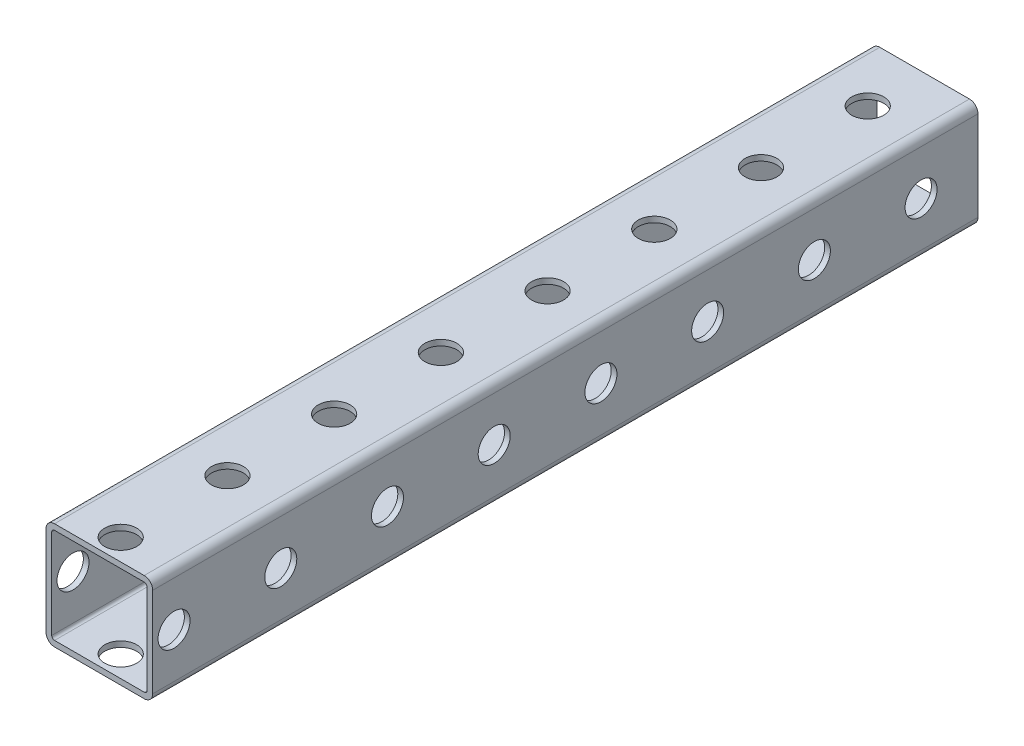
from build123d import *

# Parameters (mm, degrees)
BOSS_EXTRUDE1_DEPTH = 368.3
SKETCH3_R           = 7.14375
CUT_EXTRUDE1_DEPTH  = 375.40776067
SKETCH4_R           = 7.14375
CUT_EXTRUDE2_DEPTH  = 374.942221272
LPATTERN1_COUNT     = 8
LPATTERN1_PITCH     = 47.625


with BuildPart() as part:
    # Sketch1 → Boss-Extrude1 (new body)
    with BuildSketch(Plane.XY):
        with BuildLine():
            Line((0, 47.625), (40.005, 47.625))
            ThreePointArc((40.005, 47.625), (42.699076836, 46.509076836), (43.815, 43.815))
            Line((43.815, 43.815), (43.815, 3.81))
            ThreePointArc((43.815, 3.81), (42.699076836, 1.115923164), (40.005, 0))
            Line((40.005, 0), (0, 0))
            ThreePointArc((0, 0), (-2.694076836, 1.115923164), (-3.81, 3.81))
            Line((-3.81, 3.81), (-3.81, 43.815))
            ThreePointArc((-3.81, 43.815), (-2.694076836, 46.509076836), (0, 47.625))
        make_face()
        with BuildLine():
            Line((-1.27, 43.815), (-1.27, 3.81))
            ThreePointArc((-1.27, 3.81), (-0.898025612, 2.911974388), (0, 2.54))
            Line((0, 2.54), (40.005, 2.54))
            ThreePointArc((40.005, 2.54), (40.903025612, 2.911974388), (41.275, 3.81))
            Line((41.275, 3.81), (41.275, 43.815))
            ThreePointArc((41.275, 43.815), (40.903025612, 44.713025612), (40.005, 45.085))
            Line((40.005, 45.085), (0, 45.085))
            ThreePointArc((0, 45.085), (-0.898025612, 44.713025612), (-1.27, 43.815))
        make_face(mode=Mode.SUBTRACT)
    extrude(amount=BOSS_EXTRUDE1_DEPTH)

    # Sketch3 → Cut-Extrude1 (cut, through all)
    with BuildSketch(Plane(origin=(43.815, 0, 0), x_dir=(0, 0, -1), z_dir=(1, 0, 0))):
        with Locations((-25.4, 23.8125)):
            Circle(SKETCH3_R)
    cut_extrude1 = extrude(amount=-CUT_EXTRUDE1_DEPTH, mode=Mode.SUBTRACT)

    # Sketch4 → Cut-Extrude2 (cut, through all)
    with BuildSketch(Plane(origin=(0, 47.625, 0), x_dir=(1, 0, 0), z_dir=(0, 1, 0))):
        with Locations(Location((20.0025, -25.4, 0), (0, 0, 270))):
            Circle(SKETCH4_R)
    cut_extrude2 = extrude(amount=-CUT_EXTRUDE2_DEPTH, mode=Mode.SUBTRACT)

    # LPattern1: Cut-Extrude1, Cut-Extrude2 ×8
    with Locations(*[(0, 0, i * LPATTERN1_PITCH) for i in range(1, LPATTERN1_COUNT)]):
        add(cut_extrude1, mode=Mode.SUBTRACT)
        add(cut_extrude2, mode=Mode.SUBTRACT)


solid = part.part
